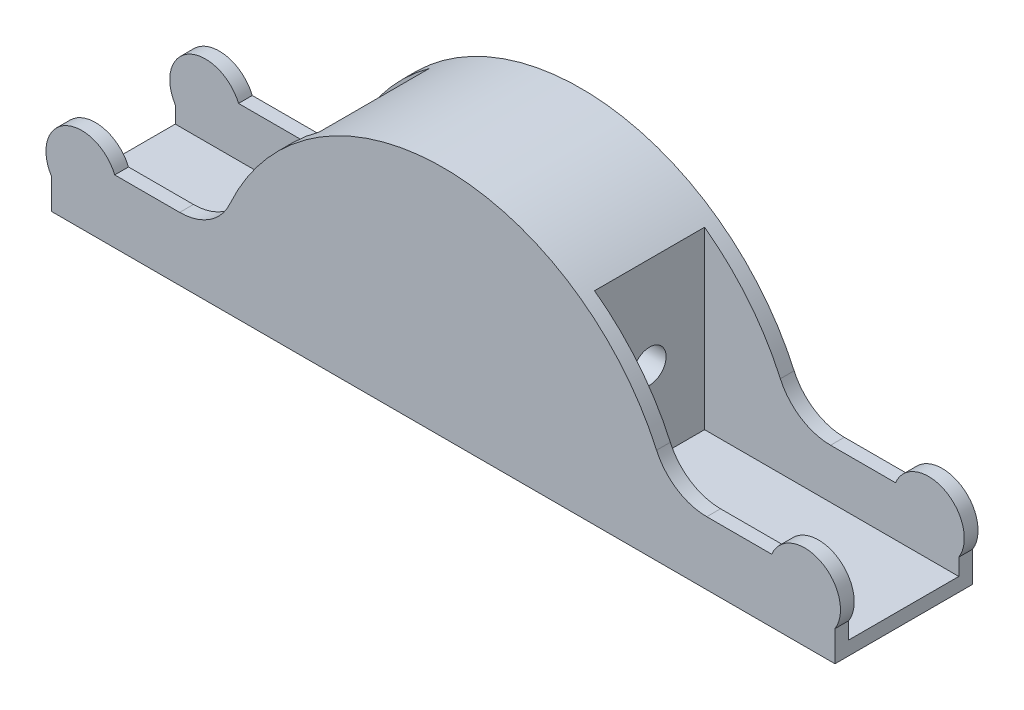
ISO-10303-21;
HEADER;
FILE_DESCRIPTION(('STEP AP214'),'2;1');
FILE_NAME('part.step','',(''),(''),'','','');
FILE_SCHEMA(('AUTOMOTIVE_DESIGN { 1 0 10303 214 1 1 1 1 }'));
ENDSEC;
DATA;
#1=APPLICATION_CONTEXT('core data for automotive mechanical design processes');
#2=APPLICATION_PROTOCOL_DEFINITION('international standard','automotive_design',2000,#1);
#3=PRODUCT_CONTEXT('',#1,'mechanical');
#4=PRODUCT('Part','Part','',(#3));
#5=PRODUCT_RELATED_PRODUCT_CATEGORY('part','',(#4));
#6=PRODUCT_DEFINITION_FORMATION('','',#4);
#7=PRODUCT_DEFINITION_CONTEXT('part definition',#1,'design');
#8=PRODUCT_DEFINITION('design','',#6,#7);
#9=PRODUCT_DEFINITION_SHAPE('','',#8);
#10=(LENGTH_UNIT() NAMED_UNIT(*) SI_UNIT(.MILLI.,.METRE.));
#11=(NAMED_UNIT(*) PLANE_ANGLE_UNIT() SI_UNIT($,.RADIAN.));
#12=(NAMED_UNIT(*) SI_UNIT($,.STERADIAN.) SOLID_ANGLE_UNIT());
#13=UNCERTAINTY_MEASURE_WITH_UNIT(LENGTH_MEASURE(1.E-05),#10,'distance_accuracy_value','');
#14=(GEOMETRIC_REPRESENTATION_CONTEXT(3) GLOBAL_UNCERTAINTY_ASSIGNED_CONTEXT((#13)) GLOBAL_UNIT_ASSIGNED_CONTEXT((#10,
#11,#12)) REPRESENTATION_CONTEXT('',''));
#15=CARTESIAN_POINT('',(0.,0.,0.));
#16=DIRECTION('',(0.,0.,1.));
#17=DIRECTION('',(1.,0.,0.));
#18=AXIS2_PLACEMENT_3D('',#15,#16,#17);
#19=CARTESIAN_POINT('',(657.,89.9999999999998,250.));
#20=DIRECTION('',(0.,0.,-1.));
#21=DIRECTION('',(-1.,0.,0.));
#22=AXIS2_PLACEMENT_3D('',#19,#20,#21);
#23=CYLINDRICAL_SURFACE('',#22,64.9999999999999);
#24=DIRECTION('',(0.,0.,-1.));
#25=VECTOR('',#24,1.);
#26=CARTESIAN_POINT('',(597.,115.,250.));
#27=LINE('',#26,#25);
#28=CARTESIAN_POINT('',(597.,115.,25.));
#29=VERTEX_POINT('',#28);
#30=CARTESIAN_POINT('',(597.,115.,0.));
#31=VERTEX_POINT('',#30);
#32=EDGE_CURVE('E202',#29,#31,#27,.T.);
#33=ORIENTED_EDGE('',*,*,#32,.F.);
#34=CARTESIAN_POINT('',(657.,89.9999999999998,25.));
#35=DIRECTION('',(0.,0.,-1.));
#36=DIRECTION('',(-1.,0.,0.));
#37=AXIS2_PLACEMENT_3D('',#34,#35,#36);
#38=CIRCLE('',#37,64.9999999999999);
#39=CARTESIAN_POINT('',(712.,55.3589838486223,25.));
#40=VERTEX_POINT('',#39);
#41=EDGE_CURVE('E403',#29,#40,#38,.T.);
#42=ORIENTED_EDGE('',*,*,#41,.T.);
#43=DIRECTION('',(0.,0.,-1.));
#44=VECTOR('',#43,1.);
#45=CARTESIAN_POINT('',(712.,55.3589838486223,250.));
#46=LINE('',#45,#44);
#47=CARTESIAN_POINT('',(712.,55.3589838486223,0.));
#48=VERTEX_POINT('',#47);
#49=EDGE_CURVE('E206',#40,#48,#46,.T.);
#50=ORIENTED_EDGE('',*,*,#49,.T.);
#51=CARTESIAN_POINT('',(657.,89.9999999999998,0.));
#52=DIRECTION('',(0.,0.,1.));
#53=DIRECTION('',(-1.,0.,0.));
#54=AXIS2_PLACEMENT_3D('',#51,#52,#53);
#55=CIRCLE('',#54,64.9999999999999);
#56=EDGE_CURVE('E166',#48,#31,#55,.T.);
#57=ORIENTED_EDGE('',*,*,#56,.T.);
#58=EDGE_LOOP('',(#33,#42,#50,#57));
#59=FACE_BOUND('',#58,.T.);
#60=ADVANCED_FACE('F32',(#59),#23,.T.);
#61=CARTESIAN_POINT('',(478.957200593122,115.,250.));
#62=DIRECTION('',(0.,-1.,0.));
#63=DIRECTION('',(1.,0.,0.));
#64=AXIS2_PLACEMENT_3D('',#61,#62,#63);
#65=PLANE('',#64);
#66=DIRECTION('',(0.,0.,-1.));
#67=VECTOR('',#66,1.);
#68=CARTESIAN_POINT('',(478.957200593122,115.,250.));
#69=LINE('',#68,#67);
#70=CARTESIAN_POINT('',(478.957200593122,115.,25.));
#71=VERTEX_POINT('',#70);
#72=CARTESIAN_POINT('',(478.957200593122,115.,0.));
#73=VERTEX_POINT('',#72);
#74=EDGE_CURVE('E198',#71,#73,#69,.T.);
#75=ORIENTED_EDGE('',*,*,#74,.F.);
#76=DIRECTION('',(1.,0.,0.));
#77=VECTOR('',#76,1.);
#78=CARTESIAN_POINT('',(478.957200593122,115.,25.));
#79=LINE('',#78,#77);
#80=EDGE_CURVE('E400',#71,#29,#79,.T.);
#81=ORIENTED_EDGE('',*,*,#80,.T.);
#82=ORIENTED_EDGE('',*,*,#32,.T.);
#83=DIRECTION('',(-1.,0.,0.));
#84=VECTOR('',#83,1.);
#85=CARTESIAN_POINT('',(478.957200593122,115.,0.));
#86=LINE('',#85,#84);
#87=EDGE_CURVE('E169',#31,#73,#86,.T.);
#88=ORIENTED_EDGE('',*,*,#87,.T.);
#89=EDGE_LOOP('',(#75,#81,#82,#88));
#90=FACE_BOUND('',#89,.T.);
#91=ADVANCED_FACE('F450',(#90),#65,.F.);
#92=CARTESIAN_POINT('',(478.957200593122,215.,250.));
#93=DIRECTION('',(0.,0.,-1.));
#94=DIRECTION('',(-1.,0.,0.));
#95=AXIS2_PLACEMENT_3D('',#92,#93,#94);
#96=CYLINDRICAL_SURFACE('',#95,99.9999999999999);
#97=DIRECTION('',(0.,0.,-1.));
#98=VECTOR('',#97,1.);
#99=CARTESIAN_POINT('',(387.727257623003,174.047619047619,250.));
#100=LINE('',#99,#98);
#101=CARTESIAN_POINT('',(387.727257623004,174.047619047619,25.));
#102=VERTEX_POINT('',#101);
#103=CARTESIAN_POINT('',(387.727257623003,174.047619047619,0.));
#104=VERTEX_POINT('',#103);
#105=EDGE_CURVE('E194',#102,#104,#100,.T.);
#106=ORIENTED_EDGE('',*,*,#105,.F.);
#107=CARTESIAN_POINT('',(478.957200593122,215.,25.));
#108=DIRECTION('',(0.,0.,-1.));
#109=DIRECTION('',(-1.,0.,0.));
#110=AXIS2_PLACEMENT_3D('',#107,#108,#109);
#111=CIRCLE('',#110,99.9999999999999);
#112=EDGE_CURVE('E250',#102,#71,#111,.F.);
#113=ORIENTED_EDGE('',*,*,#112,.T.);
#114=ORIENTED_EDGE('',*,*,#74,.T.);
#115=CARTESIAN_POINT('',(478.957200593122,215.,0.));
#116=DIRECTION('',(0.,0.,-1.));
#117=DIRECTION('',(-1.,0.,0.));
#118=AXIS2_PLACEMENT_3D('',#115,#116,#117);
#119=CIRCLE('',#118,99.9999999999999);
#120=EDGE_CURVE('E172',#73,#104,#119,.T.);
#121=ORIENTED_EDGE('',*,*,#120,.T.);
#122=EDGE_LOOP('',(#106,#113,#114,#121));
#123=FACE_BOUND('',#122,.T.);
#124=ADVANCED_FACE('F249',(#123),#96,.F.);
#125=CARTESIAN_POINT('',(-478.957200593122,215.,250.));
#126=DIRECTION('',(0.,0.,-1.));
#127=DIRECTION('',(-1.,0.,0.));
#128=AXIS2_PLACEMENT_3D('',#125,#126,#127);
#129=CYLINDRICAL_SURFACE('',#128,100.);
#130=DIRECTION('',(0.,0.,-1.));
#131=VECTOR('',#130,1.);
#132=CARTESIAN_POINT('',(-387.727257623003,174.047619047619,250.));
#133=LINE('',#132,#131);
#134=CARTESIAN_POINT('',(-387.727257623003,174.047619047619,250.));
#135=VERTEX_POINT('',#134);
#136=CARTESIAN_POINT('',(-387.727257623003,174.047619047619,225.));
#137=VERTEX_POINT('',#136);
#138=EDGE_CURVE('E192',#135,#137,#133,.T.);
#139=ORIENTED_EDGE('',*,*,#138,.T.);
#140=CARTESIAN_POINT('',(-478.957200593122,215.,225.));
#141=DIRECTION('',(0.,0.,1.));
#142=DIRECTION('',(1.,0.,0.));
#143=AXIS2_PLACEMENT_3D('',#140,#141,#142);
#144=CIRCLE('',#143,100.);
#145=CARTESIAN_POINT('',(-478.957200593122,115.,225.));
#146=VERTEX_POINT('',#145);
#147=EDGE_CURVE('E145',#137,#146,#144,.F.);
#148=ORIENTED_EDGE('',*,*,#147,.T.);
#149=DIRECTION('',(0.,0.,-1.));
#150=VECTOR('',#149,1.);
#151=CARTESIAN_POINT('',(-478.957200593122,115.,250.));
#152=LINE('',#151,#150);
#153=CARTESIAN_POINT('',(-478.957200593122,115.,250.));
#154=VERTEX_POINT('',#153);
#155=EDGE_CURVE('E141',#154,#146,#152,.T.);
#156=ORIENTED_EDGE('',*,*,#155,.F.);
#157=CARTESIAN_POINT('',(-478.957200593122,215.,250.));
#158=DIRECTION('',(0.,0.,-1.));
#159=DIRECTION('',(1.,0.,0.));
#160=AXIS2_PLACEMENT_3D('',#157,#158,#159);
#161=CIRCLE('',#160,100.);
#162=EDGE_CURVE('E127',#135,#154,#161,.T.);
#163=ORIENTED_EDGE('',*,*,#162,.F.);
#164=EDGE_LOOP('',(#139,#148,#156,#163));
#165=FACE_BOUND('',#164,.T.);
#166=ADVANCED_FACE('F142',(#165),#129,.F.);
#167=CARTESIAN_POINT('',(-597.,115.,250.));
#168=DIRECTION('',(0.,-1.,0.));
#169=DIRECTION('',(1.,0.,0.));
#170=AXIS2_PLACEMENT_3D('',#167,#168,#169);
#171=PLANE('',#170);
#172=ORIENTED_EDGE('',*,*,#155,.T.);
#173=DIRECTION('',(-1.,0.,0.));
#174=VECTOR('',#173,1.);
#175=CARTESIAN_POINT('',(-597.,115.,225.));
#176=LINE('',#175,#174);
#177=CARTESIAN_POINT('',(-597.,115.,225.));
#178=VERTEX_POINT('',#177);
#179=EDGE_CURVE('E287',#146,#178,#176,.T.);
#180=ORIENTED_EDGE('',*,*,#179,.T.);
#181=DIRECTION('',(0.,0.,-1.));
#182=VECTOR('',#181,1.);
#183=CARTESIAN_POINT('',(-597.,115.,250.));
#184=LINE('',#183,#182);
#185=CARTESIAN_POINT('',(-597.,115.,250.));
#186=VERTEX_POINT('',#185);
#187=EDGE_CURVE('E153',#186,#178,#184,.T.);
#188=ORIENTED_EDGE('',*,*,#187,.F.);
#189=DIRECTION('',(-1.,0.,0.));
#190=VECTOR('',#189,1.);
#191=CARTESIAN_POINT('',(-597.,115.,250.));
#192=LINE('',#191,#190);
#193=EDGE_CURVE('E131',#154,#186,#192,.T.);
#194=ORIENTED_EDGE('',*,*,#193,.F.);
#195=EDGE_LOOP('',(#172,#180,#188,#194));
#196=FACE_BOUND('',#195,.T.);
#197=ADVANCED_FACE('F151',(#196),#171,.F.);
#198=CARTESIAN_POINT('',(-657.,89.9999999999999,250.));
#199=DIRECTION('',(0.,0.,-1.));
#200=DIRECTION('',(-1.,0.,0.));
#201=AXIS2_PLACEMENT_3D('',#198,#199,#200);
#202=CYLINDRICAL_SURFACE('',#201,64.9999999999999);
#203=CARTESIAN_POINT('',(-657.,89.9999999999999,225.));
#204=DIRECTION('',(0.,0.,1.));
#205=DIRECTION('',(1.,0.,0.));
#206=AXIS2_PLACEMENT_3D('',#203,#204,#205);
#207=CIRCLE('',#206,64.9999999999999);
#208=CARTESIAN_POINT('',(-712.,55.3589838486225,225.));
#209=VERTEX_POINT('',#208);
#210=EDGE_CURVE('E218',#178,#209,#207,.T.);
#211=ORIENTED_EDGE('',*,*,#210,.T.);
#212=DIRECTION('',(0.,0.,-1.));
#213=VECTOR('',#212,1.);
#214=CARTESIAN_POINT('',(-712.,55.3589838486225,250.));
#215=LINE('',#214,#213);
#216=CARTESIAN_POINT('',(-712.,55.3589838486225,250.));
#217=VERTEX_POINT('',#216);
#218=EDGE_CURVE('E187',#217,#209,#215,.T.);
#219=ORIENTED_EDGE('',*,*,#218,.F.);
#220=CARTESIAN_POINT('',(-657.,89.9999999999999,250.));
#221=DIRECTION('',(0.,0.,1.));
#222=DIRECTION('',(1.,0.,0.));
#223=AXIS2_PLACEMENT_3D('',#220,#221,#222);
#224=CIRCLE('',#223,64.9999999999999);
#225=EDGE_CURVE('E57',#186,#217,#224,.T.);
#226=ORIENTED_EDGE('',*,*,#225,.F.);
#227=ORIENTED_EDGE('',*,*,#187,.T.);
#228=EDGE_LOOP('',(#211,#219,#226,#227));
#229=FACE_BOUND('',#228,.T.);
#230=ADVANCED_FACE('F435',(#229),#202,.T.);
#231=CARTESIAN_POINT('',(-712.,0.,250.));
#232=DIRECTION('',(1.,0.,0.));
#233=DIRECTION('',(0.,0.,-1.));
#234=AXIS2_PLACEMENT_3D('',#231,#232,#233);
#235=PLANE('',#234);
#236=ORIENTED_EDGE('',*,*,#218,.T.);
#237=DIRECTION('',(0.,-1.,0.));
#238=VECTOR('',#237,1.);
#239=CARTESIAN_POINT('',(-712.,0.,225.));
#240=LINE('',#239,#238);
#241=CARTESIAN_POINT('',(-712.,25.,225.));
#242=VERTEX_POINT('',#241);
#243=EDGE_CURVE('E161',#209,#242,#240,.T.);
#244=ORIENTED_EDGE('',*,*,#243,.T.);
#245=DIRECTION('',(0.,0.,1.));
#246=VECTOR('',#245,1.);
#247=CARTESIAN_POINT('',(-712.,25.,250.));
#248=LINE('',#247,#246);
#249=CARTESIAN_POINT('',(-712.,25.,25.));
#250=VERTEX_POINT('',#249);
#251=EDGE_CURVE('E224',#250,#242,#248,.T.);
#252=ORIENTED_EDGE('',*,*,#251,.F.);
#253=DIRECTION('',(0.,1.,0.));
#254=VECTOR('',#253,1.);
#255=CARTESIAN_POINT('',(-712.,0.,25.));
#256=LINE('',#255,#254);
#257=CARTESIAN_POINT('',(-712.,55.3589838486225,25.));
#258=VERTEX_POINT('',#257);
#259=EDGE_CURVE('E280',#250,#258,#256,.T.);
#260=ORIENTED_EDGE('',*,*,#259,.T.);
#261=CARTESIAN_POINT('',(-712.,55.3589838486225,0.));
#262=VERTEX_POINT('',#261);
#263=EDGE_CURVE('E97',#258,#262,#215,.T.);
#264=ORIENTED_EDGE('',*,*,#263,.T.);
#265=DIRECTION('',(0.,-1.,0.));
#266=VECTOR('',#265,1.);
#267=CARTESIAN_POINT('',(-712.,0.,0.));
#268=LINE('',#267,#266);
#269=CARTESIAN_POINT('',(-712.,0.,0.));
#270=VERTEX_POINT('',#269);
#271=EDGE_CURVE('E158',#262,#270,#268,.T.);
#272=ORIENTED_EDGE('',*,*,#271,.T.);
#273=DIRECTION('',(0.,0.,-1.));
#274=VECTOR('',#273,1.);
#275=CARTESIAN_POINT('',(-712.,0.,250.));
#276=LINE('',#275,#274);
#277=CARTESIAN_POINT('',(-712.,0.,250.));
#278=VERTEX_POINT('',#277);
#279=EDGE_CURVE('E213',#278,#270,#276,.T.);
#280=ORIENTED_EDGE('',*,*,#279,.F.);
#281=DIRECTION('',(0.,-1.,0.));
#282=VECTOR('',#281,1.);
#283=CARTESIAN_POINT('',(-712.,0.,250.));
#284=LINE('',#283,#282);
#285=EDGE_CURVE('E186',#217,#278,#284,.T.);
#286=ORIENTED_EDGE('',*,*,#285,.F.);
#287=EDGE_LOOP('',(#236,#244,#252,#260,#264,#272,#280,#286));
#288=FACE_BOUND('',#287,.T.);
#289=ADVANCED_FACE('F34',(#288),#235,.F.);
#290=CARTESIAN_POINT('',(-712.,0.,250.));
#291=DIRECTION('',(0.,1.,0.));
#292=DIRECTION('',(0.,0.,1.));
#293=AXIS2_PLACEMENT_3D('',#290,#291,#292);
#294=PLANE('',#293);
#295=DIRECTION('',(1.,0.,0.));
#296=VECTOR('',#295,1.);
#297=CARTESIAN_POINT('',(-712.,0.,0.));
#298=LINE('',#297,#296);
#299=CARTESIAN_POINT('',(712.,0.,0.));
#300=VERTEX_POINT('',#299);
#301=EDGE_CURVE('E160',#270,#300,#298,.T.);
#302=ORIENTED_EDGE('',*,*,#301,.T.);
#303=DIRECTION('',(0.,0.,-1.));
#304=VECTOR('',#303,1.);
#305=CARTESIAN_POINT('',(712.,0.,250.));
#306=LINE('',#305,#304);
#307=CARTESIAN_POINT('',(712.,0.,250.));
#308=VERTEX_POINT('',#307);
#309=EDGE_CURVE('E210',#308,#300,#306,.T.);
#310=ORIENTED_EDGE('',*,*,#309,.F.);
#311=DIRECTION('',(1.,0.,0.));
#312=VECTOR('',#311,1.);
#313=CARTESIAN_POINT('',(-712.,0.,250.));
#314=LINE('',#313,#312);
#315=EDGE_CURVE('E106',#278,#308,#314,.T.);
#316=ORIENTED_EDGE('',*,*,#315,.F.);
#317=ORIENTED_EDGE('',*,*,#279,.T.);
#318=EDGE_LOOP('',(#302,#310,#316,#317));
#319=FACE_BOUND('',#318,.T.);
#320=ADVANCED_FACE('F443',(#319),#294,.F.);
#321=CARTESIAN_POINT('',(712.,55.3589838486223,250.));
#322=DIRECTION('',(-1.,0.,0.));
#323=DIRECTION('',(0.,0.,1.));
#324=AXIS2_PLACEMENT_3D('',#321,#322,#323);
#325=PLANE('',#324);
#326=ORIENTED_EDGE('',*,*,#49,.F.);
#327=DIRECTION('',(0.,-1.,0.));
#328=VECTOR('',#327,1.);
#329=CARTESIAN_POINT('',(712.,55.3589838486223,25.));
#330=LINE('',#329,#328);
#331=CARTESIAN_POINT('',(712.,25.,25.));
#332=VERTEX_POINT('',#331);
#333=EDGE_CURVE('E406',#40,#332,#330,.T.);
#334=ORIENTED_EDGE('',*,*,#333,.T.);
#335=DIRECTION('',(0.,0.,1.));
#336=VECTOR('',#335,1.);
#337=CARTESIAN_POINT('',(712.,25.,250.));
#338=LINE('',#337,#336);
#339=CARTESIAN_POINT('',(712.,25.,225.));
#340=VERTEX_POINT('',#339);
#341=EDGE_CURVE('E11',#332,#340,#338,.T.);
#342=ORIENTED_EDGE('',*,*,#341,.T.);
#343=DIRECTION('',(0.,1.,0.));
#344=VECTOR('',#343,1.);
#345=CARTESIAN_POINT('',(712.,55.3589838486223,225.));
#346=LINE('',#345,#344);
#347=CARTESIAN_POINT('',(712.,55.3589838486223,225.));
#348=VERTEX_POINT('',#347);
#349=EDGE_CURVE('E382',#340,#348,#346,.T.);
#350=ORIENTED_EDGE('',*,*,#349,.T.);
#351=CARTESIAN_POINT('',(712.,55.3589838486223,250.));
#352=VERTEX_POINT('',#351);
#353=EDGE_CURVE('E207',#352,#348,#46,.T.);
#354=ORIENTED_EDGE('',*,*,#353,.F.);
#355=DIRECTION('',(0.,1.,0.));
#356=VECTOR('',#355,1.);
#357=CARTESIAN_POINT('',(712.,55.3589838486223,250.));
#358=LINE('',#357,#356);
#359=EDGE_CURVE('E297',#308,#352,#358,.T.);
#360=ORIENTED_EDGE('',*,*,#359,.F.);
#361=ORIENTED_EDGE('',*,*,#309,.T.);
#362=DIRECTION('',(0.,1.,0.));
#363=VECTOR('',#362,1.);
#364=CARTESIAN_POINT('',(712.,55.3589838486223,0.));
#365=LINE('',#364,#363);
#366=EDGE_CURVE('E163',#300,#48,#365,.T.);
#367=ORIENTED_EDGE('',*,*,#366,.T.);
#368=EDGE_LOOP('',(#326,#334,#342,#350,#354,#360,#361,#367));
#369=FACE_BOUND('',#368,.T.);
#370=ADVANCED_FACE('F463',(#369),#325,.F.);
#371=CARTESIAN_POINT('',(657.,89.9999999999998,225.));
#372=DIRECTION('',(0.,0.,1.));
#373=DIRECTION('',(1.,0.,0.));
#374=AXIS2_PLACEMENT_3D('',#371,#372,#373);
#375=CIRCLE('',#374,64.9999999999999);
#376=CARTESIAN_POINT('',(597.,115.,225.));
#377=VERTEX_POINT('',#376);
#378=EDGE_CURVE('E396',#348,#377,#375,.T.);
#379=ORIENTED_EDGE('',*,*,#378,.T.);
#380=CARTESIAN_POINT('',(597.,115.,250.));
#381=VERTEX_POINT('',#380);
#382=EDGE_CURVE('E203',#381,#377,#27,.T.);
#383=ORIENTED_EDGE('',*,*,#382,.F.);
#384=CARTESIAN_POINT('',(657.,89.9999999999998,250.));
#385=DIRECTION('',(0.,0.,1.));
#386=DIRECTION('',(-1.,0.,0.));
#387=AXIS2_PLACEMENT_3D('',#384,#385,#386);
#388=CIRCLE('',#387,64.9999999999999);
#389=EDGE_CURVE('E299',#352,#381,#388,.T.);
#390=ORIENTED_EDGE('',*,*,#389,.F.);
#391=ORIENTED_EDGE('',*,*,#353,.T.);
#392=EDGE_LOOP('',(#379,#383,#390,#391));
#393=FACE_BOUND('',#392,.T.);
#394=ADVANCED_FACE('F453',(#393),#23,.T.);
#395=ORIENTED_EDGE('',*,*,#382,.T.);
#396=DIRECTION('',(-1.,0.,0.));
#397=VECTOR('',#396,1.);
#398=CARTESIAN_POINT('',(478.957200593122,115.,225.));
#399=LINE('',#398,#397);
#400=CARTESIAN_POINT('',(478.957200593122,115.,225.));
#401=VERTEX_POINT('',#400);
#402=EDGE_CURVE('E393',#377,#401,#399,.T.);
#403=ORIENTED_EDGE('',*,*,#402,.T.);
#404=CARTESIAN_POINT('',(478.957200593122,115.,250.));
#405=VERTEX_POINT('',#404);
#406=EDGE_CURVE('E199',#405,#401,#69,.T.);
#407=ORIENTED_EDGE('',*,*,#406,.F.);
#408=DIRECTION('',(-1.,0.,0.));
#409=VECTOR('',#408,1.);
#410=CARTESIAN_POINT('',(478.957200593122,115.,250.));
#411=LINE('',#410,#409);
#412=EDGE_CURVE('E301',#381,#405,#411,.T.);
#413=ORIENTED_EDGE('',*,*,#412,.F.);
#414=EDGE_LOOP('',(#395,#403,#407,#413));
#415=FACE_BOUND('',#414,.T.);
#416=ADVANCED_FACE('F459',(#415),#65,.F.);
#417=ORIENTED_EDGE('',*,*,#406,.T.);
#418=CARTESIAN_POINT('',(478.957200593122,215.,225.));
#419=DIRECTION('',(0.,0.,1.));
#420=DIRECTION('',(1.,0.,0.));
#421=AXIS2_PLACEMENT_3D('',#418,#419,#420);
#422=CIRCLE('',#421,99.9999999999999);
#423=CARTESIAN_POINT('',(387.727257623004,174.047619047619,225.));
#424=VERTEX_POINT('',#423);
#425=EDGE_CURVE('E313',#401,#424,#422,.F.);
#426=ORIENTED_EDGE('',*,*,#425,.T.);
#427=CARTESIAN_POINT('',(387.727257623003,174.047619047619,250.));
#428=VERTEX_POINT('',#427);
#429=EDGE_CURVE('E195',#428,#424,#100,.T.);
#430=ORIENTED_EDGE('',*,*,#429,.F.);
#431=CARTESIAN_POINT('',(478.957200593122,215.,250.));
#432=DIRECTION('',(0.,0.,-1.));
#433=DIRECTION('',(-1.,0.,0.));
#434=AXIS2_PLACEMENT_3D('',#431,#432,#433);
#435=CIRCLE('',#434,99.9999999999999);
#436=EDGE_CURVE('E303',#405,#428,#435,.T.);
#437=ORIENTED_EDGE('',*,*,#436,.F.);
#438=EDGE_LOOP('',(#417,#426,#430,#437));
#439=FACE_BOUND('',#438,.T.);
#440=ADVANCED_FACE('F310',(#439),#96,.F.);
#441=CARTESIAN_POINT('',(0.,0.,250.));
#442=DIRECTION('',(0.,0.,-1.));
#443=DIRECTION('',(-1.,0.,0.));
#444=AXIS2_PLACEMENT_3D('',#441,#442,#443);
#445=CYLINDRICAL_SURFACE('',#444,425.);
#446=DIRECTION('',(0.,0.,-1.));
#447=VECTOR('',#446,1.);
#448=CARTESIAN_POINT('',(250.,343.693177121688,250.));
#449=LINE('',#448,#447);
#450=CARTESIAN_POINT('',(250.,343.693177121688,225.));
#451=VERTEX_POINT('',#450);
#452=CARTESIAN_POINT('',(250.,343.693177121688,25.));
#453=VERTEX_POINT('',#452);
#454=EDGE_CURVE('E230',#451,#453,#449,.T.);
#455=ORIENTED_EDGE('',*,*,#454,.T.);
#456=CARTESIAN_POINT('',(0.,0.,25.));
#457=DIRECTION('',(0.,0.,-1.));
#458=DIRECTION('',(-1.,0.,0.));
#459=AXIS2_PLACEMENT_3D('',#456,#457,#458);
#460=CIRCLE('',#459,425.);
#461=EDGE_CURVE('E41',#453,#102,#460,.T.);
#462=ORIENTED_EDGE('',*,*,#461,.T.);
#463=ORIENTED_EDGE('',*,*,#105,.T.);
#464=CARTESIAN_POINT('',(0.,0.,0.));
#465=DIRECTION('',(0.,0.,1.));
#466=DIRECTION('',(1.,0.,0.));
#467=AXIS2_PLACEMENT_3D('',#464,#465,#466);
#468=CIRCLE('',#467,425.);
#469=CARTESIAN_POINT('',(-387.727257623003,174.047619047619,0.));
#470=VERTEX_POINT('',#469);
#471=EDGE_CURVE('E175',#104,#470,#468,.T.);
#472=ORIENTED_EDGE('',*,*,#471,.T.);
#473=CARTESIAN_POINT('',(-387.727257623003,174.047619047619,25.));
#474=VERTEX_POINT('',#473);
#475=EDGE_CURVE('E148',#474,#470,#133,.T.);
#476=ORIENTED_EDGE('',*,*,#475,.F.);
#477=CARTESIAN_POINT('',(0.,0.,25.));
#478=DIRECTION('',(0.,0.,-1.));
#479=DIRECTION('',(-1.,0.,0.));
#480=AXIS2_PLACEMENT_3D('',#477,#478,#479);
#481=CIRCLE('',#480,425.);
#482=CARTESIAN_POINT('',(-250.,343.693177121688,25.));
#483=VERTEX_POINT('',#482);
#484=EDGE_CURVE('E265',#474,#483,#481,.T.);
#485=ORIENTED_EDGE('',*,*,#484,.T.);
#486=DIRECTION('',(0.,0.,-1.));
#487=VECTOR('',#486,1.);
#488=CARTESIAN_POINT('',(-250.,343.693177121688,250.));
#489=LINE('',#488,#487);
#490=CARTESIAN_POINT('',(-250.,343.693177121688,225.));
#491=VERTEX_POINT('',#490);
#492=EDGE_CURVE('E221',#483,#491,#489,.F.);
#493=ORIENTED_EDGE('',*,*,#492,.T.);
#494=CARTESIAN_POINT('',(0.,0.,225.));
#495=DIRECTION('',(0.,0.,1.));
#496=DIRECTION('',(1.,0.,0.));
#497=AXIS2_PLACEMENT_3D('',#494,#495,#496);
#498=CIRCLE('',#497,425.);
#499=EDGE_CURVE('E290',#491,#137,#498,.T.);
#500=ORIENTED_EDGE('',*,*,#499,.T.);
#501=ORIENTED_EDGE('',*,*,#138,.F.);
#502=CARTESIAN_POINT('',(0.,0.,250.));
#503=DIRECTION('',(0.,0.,1.));
#504=DIRECTION('',(1.,0.,0.));
#505=AXIS2_PLACEMENT_3D('',#502,#503,#504);
#506=CIRCLE('',#505,425.);
#507=EDGE_CURVE('E134',#428,#135,#506,.T.);
#508=ORIENTED_EDGE('',*,*,#507,.F.);
#509=ORIENTED_EDGE('',*,*,#429,.T.);
#510=CARTESIAN_POINT('',(0.,0.,225.));
#511=DIRECTION('',(0.,0.,1.));
#512=DIRECTION('',(1.,0.,0.));
#513=AXIS2_PLACEMENT_3D('',#510,#511,#512);
#514=CIRCLE('',#513,425.);
#515=EDGE_CURVE('E227',#424,#451,#514,.T.);
#516=ORIENTED_EDGE('',*,*,#515,.T.);
#517=EDGE_LOOP('',(#455,#462,#463,#472,#476,#485,#493,#500,#501,#508,#509,#516));
#518=FACE_BOUND('',#517,.T.);
#519=ADVANCED_FACE('F238',(#518),#445,.T.);
#520=CARTESIAN_POINT('',(-478.957200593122,115.,25.));
#521=VERTEX_POINT('',#520);
#522=CARTESIAN_POINT('',(-478.957200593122,115.,0.));
#523=VERTEX_POINT('',#522);
#524=EDGE_CURVE('E149',#521,#523,#152,.T.);
#525=ORIENTED_EDGE('',*,*,#524,.F.);
#526=CARTESIAN_POINT('',(-478.957200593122,215.,25.));
#527=DIRECTION('',(0.,0.,-1.));
#528=DIRECTION('',(-1.,0.,0.));
#529=AXIS2_PLACEMENT_3D('',#526,#527,#528);
#530=CIRCLE('',#529,100.);
#531=EDGE_CURVE('E274',#521,#474,#530,.F.);
#532=ORIENTED_EDGE('',*,*,#531,.T.);
#533=ORIENTED_EDGE('',*,*,#475,.T.);
#534=CARTESIAN_POINT('',(-478.957200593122,215.,0.));
#535=DIRECTION('',(0.,0.,-1.));
#536=DIRECTION('',(1.,0.,0.));
#537=AXIS2_PLACEMENT_3D('',#534,#535,#536);
#538=CIRCLE('',#537,100.);
#539=EDGE_CURVE('E178',#470,#523,#538,.T.);
#540=ORIENTED_EDGE('',*,*,#539,.T.);
#541=EDGE_LOOP('',(#525,#532,#533,#540));
#542=FACE_BOUND('',#541,.T.);
#543=ADVANCED_FACE('F272',(#542),#129,.F.);
#544=CARTESIAN_POINT('',(-597.,115.,25.));
#545=VERTEX_POINT('',#544);
#546=CARTESIAN_POINT('',(-597.,115.,0.));
#547=VERTEX_POINT('',#546);
#548=EDGE_CURVE('E190',#545,#547,#184,.T.);
#549=ORIENTED_EDGE('',*,*,#548,.F.);
#550=DIRECTION('',(1.,0.,0.));
#551=VECTOR('',#550,1.);
#552=CARTESIAN_POINT('',(-597.,115.,25.));
#553=LINE('',#552,#551);
#554=EDGE_CURVE('E278',#545,#521,#553,.T.);
#555=ORIENTED_EDGE('',*,*,#554,.T.);
#556=ORIENTED_EDGE('',*,*,#524,.T.);
#557=DIRECTION('',(-1.,0.,0.));
#558=VECTOR('',#557,1.);
#559=CARTESIAN_POINT('',(-597.,115.,0.));
#560=LINE('',#559,#558);
#561=EDGE_CURVE('E181',#523,#547,#560,.T.);
#562=ORIENTED_EDGE('',*,*,#561,.T.);
#563=EDGE_LOOP('',(#549,#555,#556,#562));
#564=FACE_BOUND('',#563,.T.);
#565=ADVANCED_FACE('F445',(#564),#171,.F.);
#566=CARTESIAN_POINT('',(-657.,89.9999999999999,25.));
#567=DIRECTION('',(0.,0.,-1.));
#568=DIRECTION('',(-1.,0.,0.));
#569=AXIS2_PLACEMENT_3D('',#566,#567,#568);
#570=CIRCLE('',#569,64.9999999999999);
#571=EDGE_CURVE('E215',#258,#545,#570,.T.);
#572=ORIENTED_EDGE('',*,*,#571,.T.);
#573=ORIENTED_EDGE('',*,*,#548,.T.);
#574=CARTESIAN_POINT('',(-657.,89.9999999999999,0.));
#575=DIRECTION('',(0.,0.,1.));
#576=DIRECTION('',(1.,0.,0.));
#577=AXIS2_PLACEMENT_3D('',#574,#575,#576);
#578=CIRCLE('',#577,64.9999999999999);
#579=EDGE_CURVE('E184',#547,#262,#578,.T.);
#580=ORIENTED_EDGE('',*,*,#579,.T.);
#581=ORIENTED_EDGE('',*,*,#263,.F.);
#582=EDGE_LOOP('',(#572,#573,#580,#581));
#583=FACE_BOUND('',#582,.T.);
#584=ADVANCED_FACE('F438',(#583),#202,.T.);
#585=CARTESIAN_POINT('',(-657.,89.9999999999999,250.));
#586=DIRECTION('',(0.,0.,1.));
#587=DIRECTION('',(1.,0.,0.));
#588=AXIS2_PLACEMENT_3D('',#585,#586,#587);
#589=PLANE('',#588);
#590=ORIENTED_EDGE('',*,*,#285,.T.);
#591=ORIENTED_EDGE('',*,*,#315,.T.);
#592=ORIENTED_EDGE('',*,*,#359,.T.);
#593=ORIENTED_EDGE('',*,*,#389,.T.);
#594=ORIENTED_EDGE('',*,*,#412,.T.);
#595=ORIENTED_EDGE('',*,*,#436,.T.);
#596=ORIENTED_EDGE('',*,*,#507,.T.);
#597=ORIENTED_EDGE('',*,*,#162,.T.);
#598=ORIENTED_EDGE('',*,*,#193,.T.);
#599=ORIENTED_EDGE('',*,*,#225,.T.);
#600=EDGE_LOOP('',(#590,#591,#592,#593,#594,#595,#596,#597,#598,#599));
#601=FACE_BOUND('',#600,.T.);
#602=ADVANCED_FACE('F129',(#601),#589,.T.);
#603=CARTESIAN_POINT('',(-657.,89.9999999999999,0.));
#604=DIRECTION('',(0.,0.,1.));
#605=DIRECTION('',(1.,0.,0.));
#606=AXIS2_PLACEMENT_3D('',#603,#604,#605);
#607=PLANE('',#606);
#608=ORIENTED_EDGE('',*,*,#271,.F.);
#609=ORIENTED_EDGE('',*,*,#579,.F.);
#610=ORIENTED_EDGE('',*,*,#561,.F.);
#611=ORIENTED_EDGE('',*,*,#539,.F.);
#612=ORIENTED_EDGE('',*,*,#471,.F.);
#613=ORIENTED_EDGE('',*,*,#120,.F.);
#614=ORIENTED_EDGE('',*,*,#87,.F.);
#615=ORIENTED_EDGE('',*,*,#56,.F.);
#616=ORIENTED_EDGE('',*,*,#366,.F.);
#617=ORIENTED_EDGE('',*,*,#301,.F.);
#618=EDGE_LOOP('',(#608,#609,#610,#611,#612,#613,#614,#615,#616,#617));
#619=FACE_BOUND('',#618,.T.);
#620=ADVANCED_FACE('F258',(#619),#607,.F.);
#621=CARTESIAN_POINT('',(0.,25.,0.));
#622=DIRECTION('',(0.,1.,0.));
#623=DIRECTION('',(0.,0.,1.));
#624=AXIS2_PLACEMENT_3D('',#621,#622,#623);
#625=PLANE('',#624);
#626=ORIENTED_EDGE('',*,*,#251,.T.);
#627=DIRECTION('',(-1.,0.,0.));
#628=VECTOR('',#627,1.);
#629=CARTESIAN_POINT('',(-722.,25.,225.));
#630=LINE('',#629,#628);
#631=CARTESIAN_POINT('',(-250.,25.,225.));
#632=VERTEX_POINT('',#631);
#633=EDGE_CURVE('E415',#632,#242,#630,.T.);
#634=ORIENTED_EDGE('',*,*,#633,.F.);
#635=DIRECTION('',(0.,0.,1.));
#636=VECTOR('',#635,1.);
#637=CARTESIAN_POINT('',(-250.,25.,25.));
#638=LINE('',#637,#636);
#639=CARTESIAN_POINT('',(-250.,25.,25.));
#640=VERTEX_POINT('',#639);
#641=EDGE_CURVE('E412',#640,#632,#638,.T.);
#642=ORIENTED_EDGE('',*,*,#641,.F.);
#643=DIRECTION('',(1.,0.,0.));
#644=VECTOR('',#643,1.);
#645=CARTESIAN_POINT('',(-722.,25.,25.));
#646=LINE('',#645,#644);
#647=EDGE_CURVE('E409',#250,#640,#646,.T.);
#648=ORIENTED_EDGE('',*,*,#647,.F.);
#649=EDGE_LOOP('',(#626,#634,#642,#648));
#650=FACE_BOUND('',#649,.T.);
#651=ADVANCED_FACE('F429',(#650),#625,.T.);
#652=CARTESIAN_POINT('',(-250.,621.,25.));
#653=DIRECTION('',(1.,0.,0.));
#654=DIRECTION('',(0.,0.,-1.));
#655=AXIS2_PLACEMENT_3D('',#652,#653,#654);
#656=PLANE('',#655);
#657=CARTESIAN_POINT('',(-250.,175.,125.));
#658=DIRECTION('',(-1.,0.,0.));
#659=DIRECTION('',(0.,0.,1.));
#660=AXIS2_PLACEMENT_3D('',#657,#658,#659);
#661=CIRCLE('',#660,30.);
#662=CARTESIAN_POINT('',(-250.,175.,155.));
#663=VERTEX_POINT('',#662);
#664=EDGE_CURVE('E672',#663,#663,#661,.T.);
#665=ORIENTED_EDGE('',*,*,#664,.F.);
#666=EDGE_LOOP('',(#665));
#667=FACE_BOUND('',#666,.T.);
#668=DIRECTION('',(0.,-1.,0.));
#669=VECTOR('',#668,1.);
#670=CARTESIAN_POINT('',(-250.,621.,25.));
#671=LINE('',#670,#669);
#672=EDGE_CURVE('E418',#483,#640,#671,.T.);
#673=ORIENTED_EDGE('',*,*,#672,.T.);
#674=ORIENTED_EDGE('',*,*,#641,.T.);
#675=DIRECTION('',(0.,-1.,0.));
#676=VECTOR('',#675,1.);
#677=CARTESIAN_POINT('',(-250.,621.,225.));
#678=LINE('',#677,#676);
#679=EDGE_CURVE('E282',#491,#632,#678,.T.);
#680=ORIENTED_EDGE('',*,*,#679,.F.);
#681=ORIENTED_EDGE('',*,*,#492,.F.);
#682=EDGE_LOOP('',(#673,#674,#680,#681));
#683=FACE_BOUND('',#682,.T.);
#684=ADVANCED_FACE('F421',(#667,#683),#656,.F.);
#685=CARTESIAN_POINT('',(-722.,621.,225.));
#686=DIRECTION('',(0.,0.,1.));
#687=DIRECTION('',(1.,0.,0.));
#688=AXIS2_PLACEMENT_3D('',#685,#686,#687);
#689=PLANE('',#688);
#690=ORIENTED_EDGE('',*,*,#243,.F.);
#691=ORIENTED_EDGE('',*,*,#210,.F.);
#692=ORIENTED_EDGE('',*,*,#179,.F.);
#693=ORIENTED_EDGE('',*,*,#147,.F.);
#694=ORIENTED_EDGE('',*,*,#499,.F.);
#695=ORIENTED_EDGE('',*,*,#679,.T.);
#696=ORIENTED_EDGE('',*,*,#633,.T.);
#697=EDGE_LOOP('',(#690,#691,#692,#693,#694,#695,#696));
#698=FACE_BOUND('',#697,.T.);
#699=ADVANCED_FACE('F431',(#698),#689,.F.);
#700=CARTESIAN_POINT('',(-722.,621.,25.));
#701=DIRECTION('',(0.,0.,-1.));
#702=DIRECTION('',(-1.,0.,0.));
#703=AXIS2_PLACEMENT_3D('',#700,#701,#702);
#704=PLANE('',#703);
#705=ORIENTED_EDGE('',*,*,#647,.T.);
#706=ORIENTED_EDGE('',*,*,#672,.F.);
#707=ORIENTED_EDGE('',*,*,#484,.F.);
#708=ORIENTED_EDGE('',*,*,#531,.F.);
#709=ORIENTED_EDGE('',*,*,#554,.F.);
#710=ORIENTED_EDGE('',*,*,#571,.F.);
#711=ORIENTED_EDGE('',*,*,#259,.F.);
#712=EDGE_LOOP('',(#705,#706,#707,#708,#709,#710,#711));
#713=FACE_BOUND('',#712,.T.);
#714=ADVANCED_FACE('F426',(#713),#704,.F.);
#715=CARTESIAN_POINT('',(0.,25.,0.));
#716=DIRECTION('',(0.,-1.,0.));
#717=DIRECTION('',(0.,0.,-1.));
#718=AXIS2_PLACEMENT_3D('',#715,#716,#717);
#719=PLANE('',#718);
#720=DIRECTION('',(1.,0.,0.));
#721=VECTOR('',#720,1.);
#722=CARTESIAN_POINT('',(722.,25.,25.));
#723=LINE('',#722,#721);
#724=CARTESIAN_POINT('',(250.,25.,25.));
#725=VERTEX_POINT('',#724);
#726=EDGE_CURVE('E376',#725,#332,#723,.T.);
#727=ORIENTED_EDGE('',*,*,#726,.F.);
#728=DIRECTION('',(0.,0.,-1.));
#729=VECTOR('',#728,1.);
#730=CARTESIAN_POINT('',(250.,25.,25.));
#731=LINE('',#730,#729);
#732=CARTESIAN_POINT('',(250.,25.,225.));
#733=VERTEX_POINT('',#732);
#734=EDGE_CURVE('E373',#733,#725,#731,.T.);
#735=ORIENTED_EDGE('',*,*,#734,.F.);
#736=DIRECTION('',(-1.,0.,0.));
#737=VECTOR('',#736,1.);
#738=CARTESIAN_POINT('',(722.,25.,225.));
#739=LINE('',#738,#737);
#740=EDGE_CURVE('E379',#340,#733,#739,.T.);
#741=ORIENTED_EDGE('',*,*,#740,.F.);
#742=ORIENTED_EDGE('',*,*,#341,.F.);
#743=EDGE_LOOP('',(#727,#735,#741,#742));
#744=FACE_BOUND('',#743,.T.);
#745=ADVANCED_FACE('F385',(#744),#719,.F.);
#746=CARTESIAN_POINT('',(722.,621.,25.));
#747=DIRECTION('',(0.,0.,-1.));
#748=DIRECTION('',(-1.,0.,0.));
#749=AXIS2_PLACEMENT_3D('',#746,#747,#748);
#750=PLANE('',#749);
#751=ORIENTED_EDGE('',*,*,#41,.F.);
#752=ORIENTED_EDGE('',*,*,#80,.F.);
#753=ORIENTED_EDGE('',*,*,#112,.F.);
#754=ORIENTED_EDGE('',*,*,#461,.F.);
#755=DIRECTION('',(0.,-1.,0.));
#756=VECTOR('',#755,1.);
#757=CARTESIAN_POINT('',(250.,621.,25.));
#758=LINE('',#757,#756);
#759=EDGE_CURVE('E375',#453,#725,#758,.T.);
#760=ORIENTED_EDGE('',*,*,#759,.T.);
#761=ORIENTED_EDGE('',*,*,#726,.T.);
#762=ORIENTED_EDGE('',*,*,#333,.F.);
#763=EDGE_LOOP('',(#751,#752,#753,#754,#760,#761,#762));
#764=FACE_BOUND('',#763,.T.);
#765=ADVANCED_FACE('F477',(#764),#750,.F.);
#766=CARTESIAN_POINT('',(250.,621.,25.));
#767=DIRECTION('',(-1.,0.,0.));
#768=DIRECTION('',(0.,0.,1.));
#769=AXIS2_PLACEMENT_3D('',#766,#767,#768);
#770=PLANE('',#769);
#771=CARTESIAN_POINT('',(250.,175.,125.));
#772=DIRECTION('',(-1.,0.,0.));
#773=DIRECTION('',(0.,0.,1.));
#774=AXIS2_PLACEMENT_3D('',#771,#772,#773);
#775=CIRCLE('',#774,30.);
#776=CARTESIAN_POINT('',(250.,175.,155.));
#777=VERTEX_POINT('',#776);
#778=EDGE_CURVE('E36',#777,#777,#775,.T.);
#779=ORIENTED_EDGE('',*,*,#778,.T.);
#780=EDGE_LOOP('',(#779));
#781=FACE_BOUND('',#780,.T.);
#782=DIRECTION('',(0.,-1.,0.));
#783=VECTOR('',#782,1.);
#784=CARTESIAN_POINT('',(250.,621.,225.));
#785=LINE('',#784,#783);
#786=EDGE_CURVE('E48',#451,#733,#785,.T.);
#787=ORIENTED_EDGE('',*,*,#786,.T.);
#788=ORIENTED_EDGE('',*,*,#734,.T.);
#789=ORIENTED_EDGE('',*,*,#759,.F.);
#790=ORIENTED_EDGE('',*,*,#454,.F.);
#791=EDGE_LOOP('',(#787,#788,#789,#790));
#792=FACE_BOUND('',#791,.T.);
#793=ADVANCED_FACE('F371',(#781,#792),#770,.F.);
#794=CARTESIAN_POINT('',(722.,621.,225.));
#795=DIRECTION('',(0.,0.,1.));
#796=DIRECTION('',(1.,0.,0.));
#797=AXIS2_PLACEMENT_3D('',#794,#795,#796);
#798=PLANE('',#797);
#799=ORIENTED_EDGE('',*,*,#740,.T.);
#800=ORIENTED_EDGE('',*,*,#786,.F.);
#801=ORIENTED_EDGE('',*,*,#515,.F.);
#802=ORIENTED_EDGE('',*,*,#425,.F.);
#803=ORIENTED_EDGE('',*,*,#402,.F.);
#804=ORIENTED_EDGE('',*,*,#378,.F.);
#805=ORIENTED_EDGE('',*,*,#349,.F.);
#806=EDGE_LOOP('',(#799,#800,#801,#802,#803,#804,#805));
#807=FACE_BOUND('',#806,.T.);
#808=ADVANCED_FACE('F380',(#807),#798,.F.);
#809=CARTESIAN_POINT('',(346.,175.,125.));
#810=DIRECTION('',(-1.,0.,0.));
#811=DIRECTION('',(0.,0.,1.));
#812=AXIS2_PLACEMENT_3D('',#809,#810,#811);
#813=CYLINDRICAL_SURFACE('',#812,30.);
#814=ORIENTED_EDGE('',*,*,#664,.T.);
#815=EDGE_LOOP('',(#814));
#816=FACE_BOUND('',#815,.T.);
#817=ORIENTED_EDGE('',*,*,#778,.F.);
#818=EDGE_LOOP('',(#817));
#819=FACE_BOUND('',#818,.T.);
#820=ADVANCED_FACE('F598',(#816,#819),#813,.F.);
#821=CLOSED_SHELL('',(#60,#91,#124,#166,#197,#230,#289,#320,#370,#394,#416,#440,#519,#543,#565,
#584,#602,#620,#651,#684,#699,#714,#745,#765,#793,#808,#820));
#822=MANIFOLD_SOLID_BREP('B2',#821);
#823=ADVANCED_BREP_SHAPE_REPRESENTATION('',(#18,#822),#14);
#824=SHAPE_DEFINITION_REPRESENTATION(#9,#823);
ENDSEC;
END-ISO-10303-21;
